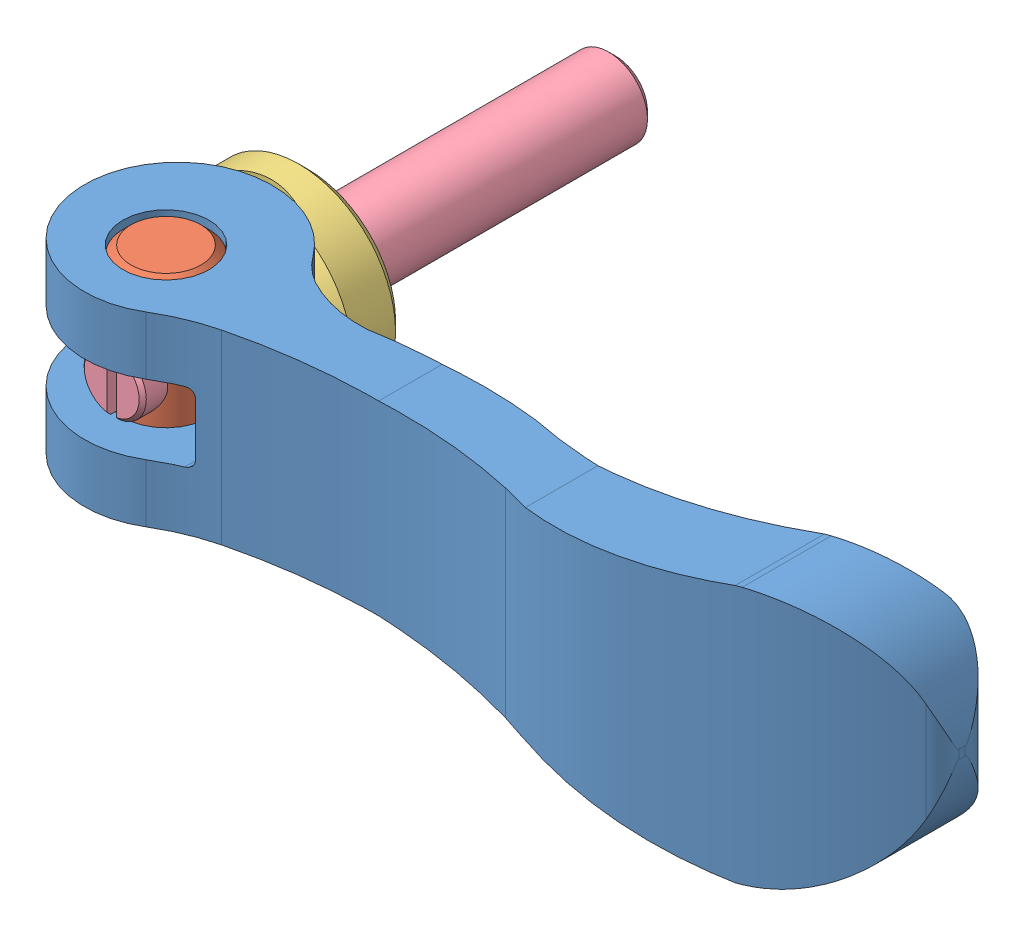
SolidWorks assembly KCL10X40-SUS.SLDASM, configuration Default (file format 15000). Lengths in mm.
Overall size (108.51 33.22 68.5).
4 component instances, 4 part files, 0 mates.
Components (placement in the parent):
- KCL10X40-SUS_01-1: KCL10X40-SUS_01.SLDPRT [ﾃﾞﾌｫﾙﾄ] at (0 0 18.3) x (1 0 0) z (0 -1 0) size (108.01 24 33.22)
- KCL10X40-SUS_02-1: KCL10X40-SUS_02.SLDPRT [ﾃﾞﾌｫﾙﾄ] at (0 0 18.3) x (0 1 0) z (1 0 0) size (24 11 11)
- KCL10X40-SUS_03-1: KCL10X40-SUS_03.SLDPRT [ﾃﾞﾌｫﾙﾄ] x (1 0 0) z (0 -1 0) size (25 8 25)
- KCL10X40-SUS_04-1: KCL10X40-SUS_04.SLDPRT [ﾃﾞﾌｫﾙﾄ] at (0 0 -24.7) x (0 1 0) z (1 0 0) size (10 65 10)
